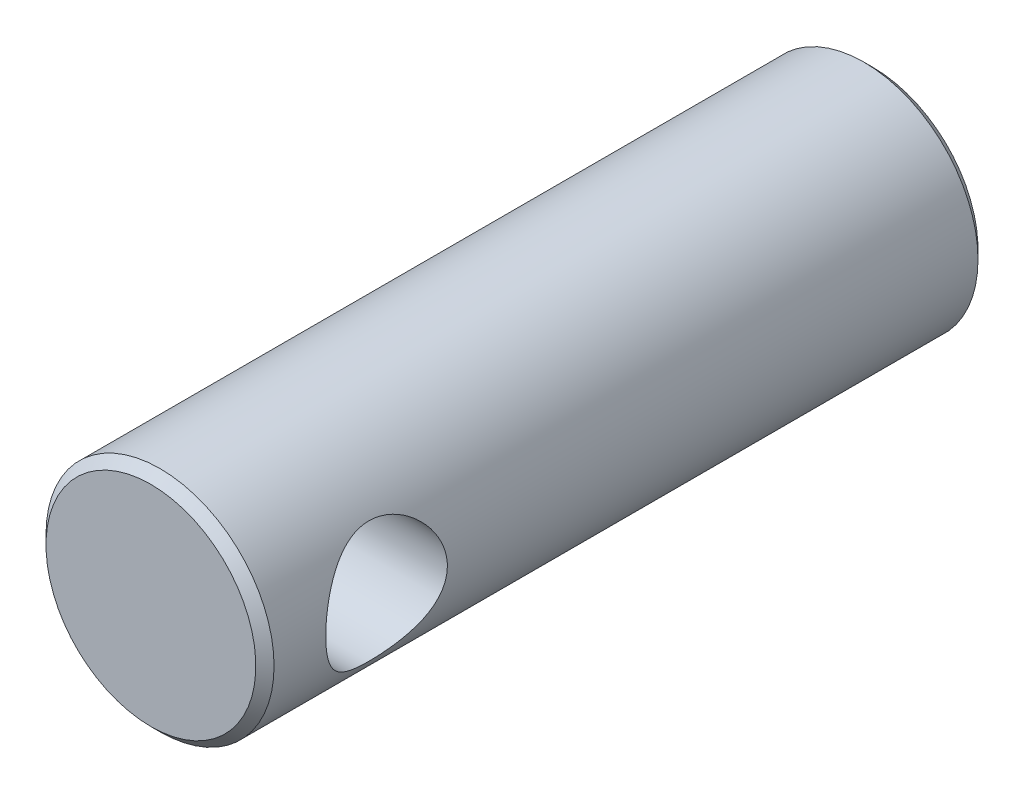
ISO-10303-21;
HEADER;
FILE_DESCRIPTION(('STEP AP214'),'2;1');
FILE_NAME('part.step','',(''),(''),'','','');
FILE_SCHEMA(('AUTOMOTIVE_DESIGN { 1 0 10303 214 1 1 1 1 }'));
ENDSEC;
DATA;
#1=APPLICATION_CONTEXT('core data for automotive mechanical design processes');
#2=APPLICATION_PROTOCOL_DEFINITION('international standard','automotive_design',2000,#1);
#3=PRODUCT_CONTEXT('',#1,'mechanical');
#4=PRODUCT('Part','Part','',(#3));
#5=PRODUCT_RELATED_PRODUCT_CATEGORY('part','',(#4));
#6=PRODUCT_DEFINITION_FORMATION('','',#4);
#7=PRODUCT_DEFINITION_CONTEXT('part definition',#1,'design');
#8=PRODUCT_DEFINITION('design','',#6,#7);
#9=PRODUCT_DEFINITION_SHAPE('','',#8);
#10=(LENGTH_UNIT() NAMED_UNIT(*) SI_UNIT(.MILLI.,.METRE.));
#11=(NAMED_UNIT(*) PLANE_ANGLE_UNIT() SI_UNIT($,.RADIAN.));
#12=(NAMED_UNIT(*) SI_UNIT($,.STERADIAN.) SOLID_ANGLE_UNIT());
#13=UNCERTAINTY_MEASURE_WITH_UNIT(LENGTH_MEASURE(1.E-05),#10,'distance_accuracy_value','');
#14=(GEOMETRIC_REPRESENTATION_CONTEXT(3) GLOBAL_UNCERTAINTY_ASSIGNED_CONTEXT((#13)) GLOBAL_UNIT_ASSIGNED_CONTEXT((#10,
#11,#12)) REPRESENTATION_CONTEXT('',''));
#15=CARTESIAN_POINT('',(0.,0.,0.));
#16=DIRECTION('',(0.,0.,1.));
#17=DIRECTION('',(1.,0.,0.));
#18=AXIS2_PLACEMENT_3D('',#15,#16,#17);
#19=CARTESIAN_POINT('',(0.,0.,0.));
#20=DIRECTION('',(0.,0.,-1.));
#21=DIRECTION('',(0.,1.,0.));
#22=AXIS2_PLACEMENT_3D('',#19,#20,#21);
#23=CYLINDRICAL_SURFACE('',#22,15.);
#24=CARTESIAN_POINT('',(0.,0.,1.2));
#25=DIRECTION('',(0.,0.,-1.));
#26=DIRECTION('',(0.,1.,0.));
#27=AXIS2_PLACEMENT_3D('',#24,#25,#26);
#28=CIRCLE('',#27,15.);
#29=CARTESIAN_POINT('',(0.,15.,1.2));
#30=VERTEX_POINT('',#29);
#31=EDGE_CURVE('E23',#30,#30,#28,.T.);
#32=ORIENTED_EDGE('',*,*,#31,.F.);
#33=EDGE_LOOP('',(#32));
#34=FACE_BOUND('',#33,.T.);
#35=CARTESIAN_POINT('',(15.,0.,71.));
#36=CARTESIAN_POINT('',(15.0000007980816,-0.208658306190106,70.9999990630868));
#37=CARTESIAN_POINT('',(14.9956371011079,-0.417305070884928,71.0081716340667));
#38=CARTESIAN_POINT('',(14.9782955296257,-0.833039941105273,71.0407582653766));
#39=CARTESIAN_POINT('',(14.9653146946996,-1.04012748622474,71.0651779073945));
#40=CARTESIAN_POINT('',(14.9310511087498,-1.45132026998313,71.1299909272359));
#41=CARTESIAN_POINT('',(14.9097590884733,-1.65542191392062,71.1704021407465));
#42=CARTESIAN_POINT('',(14.8594000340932,-2.05903163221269,71.2667306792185));
#43=CARTESIAN_POINT('',(14.830329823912,-2.25853779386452,71.3226543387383));
#44=CARTESIAN_POINT('',(14.7652710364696,-2.65067909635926,71.4490959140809));
#45=CARTESIAN_POINT('',(14.7293142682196,-2.8433411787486,71.5195468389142));
#46=CARTESIAN_POINT('',(14.6512130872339,-3.22169075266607,71.6745290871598));
#47=CARTESIAN_POINT('',(14.6090663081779,-3.40737554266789,71.7590657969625));
#48=CARTESIAN_POINT('',(14.5195395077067,-3.77066898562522,71.941435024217));
#49=CARTESIAN_POINT('',(14.4721619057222,-3.94828131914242,72.039261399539));
#50=CARTESIAN_POINT('',(14.3731581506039,-4.29474669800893,72.2475154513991));
#51=CARTESIAN_POINT('',(14.3215304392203,-4.4635964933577,72.357947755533));
#52=CARTESIAN_POINT('',(14.1548440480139,-4.97747471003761,72.7223845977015));
#53=CARTESIAN_POINT('',(14.0340440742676,-5.30593331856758,72.9975903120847));
#54=CARTESIAN_POINT('',(13.7886715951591,-5.91442733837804,73.5961172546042));
#55=CARTESIAN_POINT('',(13.6640958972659,-6.19442034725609,73.9194801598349));
#56=CARTESIAN_POINT('',(13.4779370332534,-6.58549011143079,74.4518395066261));
#57=CARTESIAN_POINT('',(13.4134290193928,-6.71554939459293,74.6461197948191));
#58=CARTESIAN_POINT('',(13.2888738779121,-6.95877033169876,75.0464750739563));
#59=CARTESIAN_POINT('',(13.2288276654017,-7.07192852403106,75.2525524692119));
#60=CARTESIAN_POINT('',(13.115350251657,-7.28022427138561,75.6752689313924));
#61=CARTESIAN_POINT('',(13.0619164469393,-7.37536892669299,75.8919037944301));
#62=CARTESIAN_POINT('',(12.963760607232,-7.54656572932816,76.3343741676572));
#63=CARTESIAN_POINT('',(12.9190331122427,-7.62262985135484,76.5602038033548));
#64=CARTESIAN_POINT('',(12.8426706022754,-7.75054950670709,77.0052074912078));
#65=CARTESIAN_POINT('',(12.8103945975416,-7.80361590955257,77.2239227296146));
#66=CARTESIAN_POINT('',(12.7565853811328,-7.89127290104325,77.6663401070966));
#67=CARTESIAN_POINT('',(12.7350516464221,-7.92586438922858,77.8900420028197));
#68=CARTESIAN_POINT('',(12.7037417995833,-7.97595273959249,78.3401523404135));
#69=CARTESIAN_POINT('',(12.6939529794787,-7.99147024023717,78.5665575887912));
#70=CARTESIAN_POINT('',(12.6865688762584,-8.00318856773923,79.0200544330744));
#71=CARTESIAN_POINT('',(12.6889721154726,-7.99939173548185,79.2471459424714));
#72=CARTESIAN_POINT('',(12.7046500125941,-7.97446092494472,79.6677563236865));
#73=CARTESIAN_POINT('',(12.7163427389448,-7.9558490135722,79.8614907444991));
#74=CARTESIAN_POINT('',(12.7482108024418,-7.90468417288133,80.2464672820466));
#75=CARTESIAN_POINT('',(12.7683888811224,-7.87212673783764,80.4377085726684));
#76=CARTESIAN_POINT('',(12.8165471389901,-7.79347407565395,80.8163582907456));
#77=CARTESIAN_POINT('',(12.8445268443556,-7.74737967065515,81.003766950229));
#78=CARTESIAN_POINT('',(12.907419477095,-7.64213821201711,81.3737596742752));
#79=CARTESIAN_POINT('',(12.9423351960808,-7.58298590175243,81.5563417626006));
#80=CARTESIAN_POINT('',(13.0189158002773,-7.45075778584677,81.9196575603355));
#81=CARTESIAN_POINT('',(13.0607123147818,-7.3774041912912,82.1002621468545));
#82=CARTESIAN_POINT('',(13.1493462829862,-7.21823996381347,82.4546727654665));
#83=CARTESIAN_POINT('',(13.1961853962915,-7.13242522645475,82.6284765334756));
#84=CARTESIAN_POINT('',(13.2937287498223,-6.94892586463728,82.9685986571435));
#85=CARTESIAN_POINT('',(13.3444336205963,-6.85123930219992,83.1349157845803));
#86=CARTESIAN_POINT('',(13.4485432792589,-6.64455222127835,83.4594783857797));
#87=CARTESIAN_POINT('',(13.5019482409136,-6.53555097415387,83.6177233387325));
#88=CARTESIAN_POINT('',(13.6183015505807,-6.28990792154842,83.9482789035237));
#89=CARTESIAN_POINT('',(13.6814984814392,-6.15155855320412,84.1192362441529));
#90=CARTESIAN_POINT('',(13.808316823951,-5.8613534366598,84.4491101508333));
#91=CARTESIAN_POINT('',(13.8719382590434,-5.70949693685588,84.6080260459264));
#92=CARTESIAN_POINT('',(13.9980647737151,-5.39288708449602,84.9131314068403));
#93=CARTESIAN_POINT('',(14.0605692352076,-5.22812684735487,85.0593139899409));
#94=CARTESIAN_POINT('',(14.1829191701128,-4.88648449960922,85.3380501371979));
#95=CARTESIAN_POINT('',(14.2427642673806,-4.70960068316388,85.470601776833));
#96=CARTESIAN_POINT('',(14.3617991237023,-4.3335781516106,85.7286819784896));
#97=CARTESIAN_POINT('',(14.4207346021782,-4.13374098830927,85.8533133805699));
#98=CARTESIAN_POINT('',(14.532297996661,-3.72258788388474,86.0850544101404));
#99=CARTESIAN_POINT('',(14.584928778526,-3.51127722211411,86.1921720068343));
#100=CARTESIAN_POINT('',(14.6823580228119,-3.07855763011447,86.3877483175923));
#101=CARTESIAN_POINT('',(14.7271600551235,-2.85715336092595,86.476215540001));
#102=CARTESIAN_POINT('',(14.807581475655,-2.40583464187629,86.6334157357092));
#103=CARTESIAN_POINT('',(14.8432020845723,-2.17592132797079,86.7021513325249));
#104=CARTESIAN_POINT('',(14.9013787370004,-1.73052917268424,86.8136505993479));
#105=CARTESIAN_POINT('',(14.9248213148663,-1.51561049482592,86.8581934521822));
#106=CARTESIAN_POINT('',(14.9625032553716,-1.08204807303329,86.9295286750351));
#107=CARTESIAN_POINT('',(14.9767431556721,-0.863404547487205,86.956322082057));
#108=CARTESIAN_POINT('',(14.9956057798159,-0.42434516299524,86.9917718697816));
#109=CARTESIAN_POINT('',(15.0002331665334,-0.203930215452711,87.0004370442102));
#110=CARTESIAN_POINT('',(14.9997487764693,0.23684557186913,86.9995290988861));
#111=CARTESIAN_POINT('',(14.9946375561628,0.457206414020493,86.9899570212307));
#112=CARTESIAN_POINT('',(14.9757321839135,0.875960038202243,86.9544170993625));
#113=CARTESIAN_POINT('',(14.962770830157,1.0745264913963,86.9300211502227));
#114=CARTESIAN_POINT('',(14.9292333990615,1.46871615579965,86.8665581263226));
#115=CARTESIAN_POINT('',(14.908654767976,1.66433835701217,86.8274861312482));
#116=CARTESIAN_POINT('',(14.8603667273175,2.05121802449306,86.735117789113));
#117=CARTESIAN_POINT('',(14.832659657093,2.24247690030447,86.6818261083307));
#118=CARTESIAN_POINT('',(14.7707189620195,2.61961877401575,86.5615339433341));
#119=CARTESIAN_POINT('',(14.7364827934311,2.8054996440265,86.4945281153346));
#120=CARTESIAN_POINT('',(14.6613087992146,3.17529209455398,86.3456252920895));
#121=CARTESIAN_POINT('',(14.6202272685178,3.35904370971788,86.2634035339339));
#122=CARTESIAN_POINT('',(14.532868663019,3.71887954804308,86.0859170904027));
#123=CARTESIAN_POINT('',(14.4865898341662,3.89496115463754,85.9906479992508));
#124=CARTESIAN_POINT('',(14.3413840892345,4.41042878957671,85.6863461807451));
#125=CARTESIAN_POINT('',(14.236045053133,4.73724051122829,85.4587364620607));
#126=CARTESIAN_POINT('',(14.0047357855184,5.38498983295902,84.9324816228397));
#127=CARTESIAN_POINT('',(13.8777653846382,5.70150577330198,84.628826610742));
#128=CARTESIAN_POINT('',(13.6884327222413,6.13611860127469,84.1377022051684));
#129=CARTESIAN_POINT('',(13.6254581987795,6.2743921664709,83.967901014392));
#130=CARTESIAN_POINT('',(13.5014696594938,6.53692255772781,83.6169941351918));
#131=CARTESIAN_POINT('',(13.4404559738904,6.6611770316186,83.4358865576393));
#132=CARTESIAN_POINT('',(13.3180882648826,6.902760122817,83.050563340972));
#133=CARTESIAN_POINT('',(13.2569910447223,7.01904976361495,82.8456133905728));
#134=CARTESIAN_POINT('',(13.1411233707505,7.23365367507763,82.4249054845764));
#135=CARTESIAN_POINT('',(13.0863498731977,7.33197660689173,82.2091528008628));
#136=CARTESIAN_POINT('',(12.9852656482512,7.50954838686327,81.7682325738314));
#137=CARTESIAN_POINT('',(12.9389473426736,7.5888143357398,81.5430736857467));
#138=CARTESIAN_POINT('',(12.8567378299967,7.72727610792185,81.0848171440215));
#139=CARTESIAN_POINT('',(12.820844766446,7.78647550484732,80.8517209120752));
#140=CARTESIAN_POINT('',(12.7641343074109,7.87905601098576,80.4027647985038));
#141=CARTESIAN_POINT('',(12.7421850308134,7.91439731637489,80.1874515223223));
#142=CARTESIAN_POINT('',(12.7091131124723,7.96739801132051,79.7538308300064));
#143=CARTESIAN_POINT('',(12.6979896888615,7.98505867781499,79.5355236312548));
#144=CARTESIAN_POINT('',(12.6870729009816,8.00239256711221,79.098039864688));
#145=CARTESIAN_POINT('',(12.6872729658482,8.00207622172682,78.8788638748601));
#146=CARTESIAN_POINT('',(12.6989789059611,7.98348651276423,78.4415891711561));
#147=CARTESIAN_POINT('',(12.7104840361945,7.96521433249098,78.2234903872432));
#148=CARTESIAN_POINT('',(12.7422128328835,7.91433991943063,77.8168004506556));
#149=CARTESIAN_POINT('',(12.7612019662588,7.88375731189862,77.6278547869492));
#150=CARTESIAN_POINT('',(12.806866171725,7.80935874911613,77.2534742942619));
#151=CARTESIAN_POINT('',(12.8335437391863,7.76553849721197,77.0680406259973));
#152=CARTESIAN_POINT('',(12.8937577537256,7.66514385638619,76.7018243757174));
#153=CARTESIAN_POINT('',(12.9272935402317,7.6085706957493,76.5210413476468));
#154=CARTESIAN_POINT('',(13.0002704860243,7.48319605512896,76.1649604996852));
#155=CARTESIAN_POINT('',(13.0397139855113,7.41438972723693,75.9896648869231));
#156=CARTESIAN_POINT('',(13.1707317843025,7.18087941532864,75.4511633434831));
#157=CARTESIAN_POINT('',(13.2709636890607,6.99548439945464,75.0988050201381));
#158=CARTESIAN_POINT('',(13.4834172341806,6.5766599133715,74.4278898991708));
#159=CARTESIAN_POINT('',(13.5956453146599,6.34320457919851,74.1093514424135));
#160=CARTESIAN_POINT('',(13.7738790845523,5.94187758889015,73.6385767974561));
#161=CARTESIAN_POINT('',(13.8391534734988,5.78858309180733,73.4734207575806));
#162=CARTESIAN_POINT('',(13.9687530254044,5.46842966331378,73.1564577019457));
#163=CARTESIAN_POINT('',(14.0330784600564,5.30157470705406,73.0046468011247));
#164=CARTESIAN_POINT('',(14.1591945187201,4.95492295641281,72.7151147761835));
#165=CARTESIAN_POINT('',(14.2209830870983,4.77511597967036,72.5774049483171));
#166=CARTESIAN_POINT('',(14.3404069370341,4.40350046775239,72.3171381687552));
#167=CARTESIAN_POINT('',(14.3980417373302,4.21169054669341,72.194582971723));
#168=CARTESIAN_POINT('',(14.5089957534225,3.81222423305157,71.9628441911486));
#169=CARTESIAN_POINT('',(14.5621739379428,3.60429410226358,71.854063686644));
#170=CARTESIAN_POINT('',(14.6610439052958,3.17829676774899,71.6546816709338));
#171=CARTESIAN_POINT('',(14.7067393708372,2.96023461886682,71.5640712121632));
#172=CARTESIAN_POINT('',(14.7892255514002,2.51590029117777,71.4022350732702));
#173=CARTESIAN_POINT('',(14.826034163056,2.28964568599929,71.3309703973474));
#174=CARTESIAN_POINT('',(14.8896933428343,1.83049251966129,71.2086136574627));
#175=CARTESIAN_POINT('',(14.9165494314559,1.5975977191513,71.1575104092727));
#176=CARTESIAN_POINT('',(14.958452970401,1.13815652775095,71.0781065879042));
#177=CARTESIAN_POINT('',(14.9739917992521,0.911819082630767,71.0488555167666));
#178=CARTESIAN_POINT('',(14.9947649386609,0.456983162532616,71.0098026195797));
#179=CARTESIAN_POINT('',(14.9999991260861,0.228484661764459,71.0000010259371));
#180=CARTESIAN_POINT('',(15.,0.,71.));
#181=B_SPLINE_CURVE_WITH_KNOTS('',3,(#35,#36,#37,#38,#39,#40,#41,#42,#43,#44,#45,#46,#47,#48,
#49,#50,#51,#52,#53,#54,#55,#56,#57,#58,#59,#60,#61,#62,#63,#64,#65,#66,#67,#68,#69,#70,#71,#72,
#73,#74,#75,#76,#77,#78,#79,#80,#81,#82,#83,#84,#85,#86,#87,#88,#89,#90,#91,#92,#93,#94,#95,#96,
#97,#98,#99,#100,#101,#102,#103,#104,#105,#106,#107,#108,#109,#110,#111,#112,#113,#114,#115,
#116,#117,#118,#119,#120,#121,#122,#123,#124,#125,#126,#127,#128,#129,#130,#131,#132,#133,#134,
#135,#136,#137,#138,#139,#140,#141,#142,#143,#144,#145,#146,#147,#148,#149,#150,#151,#152,#153,
#154,#155,#156,#157,#158,#159,#160,#161,#162,#163,#164,#165,#166,#167,#168,#169,#170,#171,#172,
#173,#174,#175,#176,#177,#178,#179,#180),.UNSPECIFIED.,.T.,.F.,(4,2,2,2,2,2,2,2,2,2,2,2,2,2,2,2,
2,2,2,2,2,2,2,2,2,2,2,2,2,2,2,2,2,2,2,2,2,2,2,2,2,2,2,2,2,2,2,2,2,2,2,2,2,2,2,2,2,2,2,2,2,2,2,2,
2,2,2,2,2,2,2,2,4),(0.,0.625750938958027,1.25171696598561,1.87838312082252,2.50530555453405,
3.12939918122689,3.75373201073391,4.37777726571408,5.00205234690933,6.33190215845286,
7.6629096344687,8.38972690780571,9.11669284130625,9.84337163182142,10.5695932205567,
11.2506745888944,11.9317227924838,12.6120334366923,13.2922616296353,13.8765020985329,
14.4609314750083,15.0453253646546,15.6299549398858,16.2274516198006,16.825145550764,
17.4229371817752,18.0207673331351,18.7065044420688,19.3922797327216,20.0784234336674,
20.764663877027,21.4920365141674,22.2190772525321,22.9457855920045,23.6723972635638,
24.3336957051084,24.9949555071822,25.6558944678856,26.3167956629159,26.9175324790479,
27.5184708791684,28.1192123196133,28.7201882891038,29.3358959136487,29.9518119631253,
31.1829817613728,32.5467200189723,33.2297017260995,33.9127978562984,34.6421568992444,
35.3711634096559,36.0995132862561,36.8277333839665,37.484661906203,38.1415429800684,
38.7980428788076,39.4544995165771,40.030889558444,40.6074668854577,41.1839887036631,
41.7607395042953,42.9874174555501,44.2147572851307,44.9178788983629,45.6207951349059,
46.3242701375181,47.0278265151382,47.7486893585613,48.469196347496,49.1882400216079,
49.9068842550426,50.5920847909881,51.2772935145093),.UNSPECIFIED.);
#182=CARTESIAN_POINT('',(15.,0.,71.));
#183=VERTEX_POINT('',#182);
#184=EDGE_CURVE('E30',#183,#183,#181,.T.);
#185=ORIENTED_EDGE('',*,*,#184,.T.);
#186=EDGE_LOOP('',(#185));
#187=FACE_BOUND('',#186,.T.);
#188=CARTESIAN_POINT('',(0.,0.,93.8));
#189=DIRECTION('',(0.,0.,-1.));
#190=DIRECTION('',(0.,1.,0.));
#191=AXIS2_PLACEMENT_3D('',#188,#189,#190);
#192=CIRCLE('',#191,15.);
#193=CARTESIAN_POINT('',(0.,15.,93.8));
#194=VERTEX_POINT('',#193);
#195=EDGE_CURVE('E37',#194,#194,#192,.T.);
#196=ORIENTED_EDGE('',*,*,#195,.T.);
#197=EDGE_LOOP('',(#196));
#198=FACE_BOUND('',#197,.T.);
#199=CARTESIAN_POINT('',(-15.,0.,71.));
#200=CARTESIAN_POINT('',(-15.0000007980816,0.208658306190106,70.9999990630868));
#201=CARTESIAN_POINT('',(-14.9956371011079,0.417305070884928,71.0081716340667));
#202=CARTESIAN_POINT('',(-14.9782955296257,0.833039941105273,71.0407582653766));
#203=CARTESIAN_POINT('',(-14.9653146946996,1.04012748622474,71.0651779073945));
#204=CARTESIAN_POINT('',(-14.9310511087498,1.45132026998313,71.1299909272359));
#205=CARTESIAN_POINT('',(-14.9097590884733,1.65542191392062,71.1704021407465));
#206=CARTESIAN_POINT('',(-14.8594000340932,2.05903163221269,71.2667306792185));
#207=CARTESIAN_POINT('',(-14.830329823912,2.25853779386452,71.3226543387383));
#208=CARTESIAN_POINT('',(-14.7652710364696,2.65067909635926,71.4490959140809));
#209=CARTESIAN_POINT('',(-14.7293142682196,2.8433411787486,71.5195468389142));
#210=CARTESIAN_POINT('',(-14.6512130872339,3.22169075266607,71.6745290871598));
#211=CARTESIAN_POINT('',(-14.6090663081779,3.40737554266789,71.7590657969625));
#212=CARTESIAN_POINT('',(-14.5195395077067,3.77066898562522,71.941435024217));
#213=CARTESIAN_POINT('',(-14.4721619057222,3.94828131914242,72.039261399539));
#214=CARTESIAN_POINT('',(-14.3731581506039,4.29474669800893,72.2475154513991));
#215=CARTESIAN_POINT('',(-14.3215304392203,4.4635964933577,72.357947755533));
#216=CARTESIAN_POINT('',(-14.1548440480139,4.97747471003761,72.7223845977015));
#217=CARTESIAN_POINT('',(-14.0340440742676,5.30593331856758,72.9975903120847));
#218=CARTESIAN_POINT('',(-13.7886715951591,5.91442733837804,73.5961172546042));
#219=CARTESIAN_POINT('',(-13.6640958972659,6.19442034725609,73.9194801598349));
#220=CARTESIAN_POINT('',(-13.4779370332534,6.58549011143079,74.4518395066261));
#221=CARTESIAN_POINT('',(-13.4134290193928,6.71554939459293,74.6461197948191));
#222=CARTESIAN_POINT('',(-13.2888738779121,6.95877033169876,75.0464750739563));
#223=CARTESIAN_POINT('',(-13.2288276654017,7.07192852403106,75.2525524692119));
#224=CARTESIAN_POINT('',(-13.115350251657,7.28022427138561,75.6752689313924));
#225=CARTESIAN_POINT('',(-13.0619164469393,7.37536892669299,75.8919037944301));
#226=CARTESIAN_POINT('',(-12.963760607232,7.54656572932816,76.3343741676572));
#227=CARTESIAN_POINT('',(-12.9190331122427,7.62262985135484,76.5602038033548));
#228=CARTESIAN_POINT('',(-12.8426706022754,7.75054950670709,77.0052074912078));
#229=CARTESIAN_POINT('',(-12.8103945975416,7.80361590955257,77.2239227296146));
#230=CARTESIAN_POINT('',(-12.7565853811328,7.89127290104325,77.6663401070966));
#231=CARTESIAN_POINT('',(-12.7350516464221,7.92586438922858,77.8900420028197));
#232=CARTESIAN_POINT('',(-12.7037417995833,7.97595273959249,78.3401523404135));
#233=CARTESIAN_POINT('',(-12.6939529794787,7.99147024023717,78.5665575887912));
#234=CARTESIAN_POINT('',(-12.6865688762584,8.00318856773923,79.0200544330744));
#235=CARTESIAN_POINT('',(-12.6889721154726,7.99939173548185,79.2471459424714));
#236=CARTESIAN_POINT('',(-12.7046500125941,7.97446092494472,79.6677563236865));
#237=CARTESIAN_POINT('',(-12.7163427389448,7.9558490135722,79.8614907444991));
#238=CARTESIAN_POINT('',(-12.7482108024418,7.90468417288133,80.2464672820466));
#239=CARTESIAN_POINT('',(-12.7683888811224,7.87212673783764,80.4377085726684));
#240=CARTESIAN_POINT('',(-12.8165471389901,7.79347407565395,80.8163582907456));
#241=CARTESIAN_POINT('',(-12.8445268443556,7.74737967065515,81.003766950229));
#242=CARTESIAN_POINT('',(-12.907419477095,7.64213821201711,81.3737596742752));
#243=CARTESIAN_POINT('',(-12.9423351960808,7.58298590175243,81.5563417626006));
#244=CARTESIAN_POINT('',(-13.0189158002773,7.45075778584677,81.9196575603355));
#245=CARTESIAN_POINT('',(-13.0607123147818,7.3774041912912,82.1002621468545));
#246=CARTESIAN_POINT('',(-13.1493462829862,7.21823996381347,82.4546727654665));
#247=CARTESIAN_POINT('',(-13.1961853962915,7.13242522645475,82.6284765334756));
#248=CARTESIAN_POINT('',(-13.2937287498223,6.94892586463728,82.9685986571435));
#249=CARTESIAN_POINT('',(-13.3444336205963,6.85123930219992,83.1349157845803));
#250=CARTESIAN_POINT('',(-13.4485432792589,6.64455222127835,83.4594783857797));
#251=CARTESIAN_POINT('',(-13.5019482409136,6.53555097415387,83.6177233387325));
#252=CARTESIAN_POINT('',(-13.6183015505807,6.28990792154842,83.9482789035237));
#253=CARTESIAN_POINT('',(-13.6814984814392,6.15155855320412,84.1192362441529));
#254=CARTESIAN_POINT('',(-13.808316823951,5.8613534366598,84.4491101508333));
#255=CARTESIAN_POINT('',(-13.8719382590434,5.70949693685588,84.6080260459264));
#256=CARTESIAN_POINT('',(-13.9980647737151,5.39288708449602,84.9131314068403));
#257=CARTESIAN_POINT('',(-14.0605692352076,5.22812684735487,85.0593139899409));
#258=CARTESIAN_POINT('',(-14.1829191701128,4.88648449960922,85.3380501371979));
#259=CARTESIAN_POINT('',(-14.2427642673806,4.70960068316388,85.470601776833));
#260=CARTESIAN_POINT('',(-14.3617991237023,4.3335781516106,85.7286819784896));
#261=CARTESIAN_POINT('',(-14.4207346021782,4.13374098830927,85.8533133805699));
#262=CARTESIAN_POINT('',(-14.532297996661,3.72258788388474,86.0850544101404));
#263=CARTESIAN_POINT('',(-14.584928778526,3.51127722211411,86.1921720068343));
#264=CARTESIAN_POINT('',(-14.6823580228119,3.07855763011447,86.3877483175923));
#265=CARTESIAN_POINT('',(-14.7271600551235,2.85715336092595,86.476215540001));
#266=CARTESIAN_POINT('',(-14.807581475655,2.40583464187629,86.6334157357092));
#267=CARTESIAN_POINT('',(-14.8432020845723,2.17592132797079,86.7021513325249));
#268=CARTESIAN_POINT('',(-14.9013787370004,1.73052917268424,86.8136505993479));
#269=CARTESIAN_POINT('',(-14.9248213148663,1.51561049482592,86.8581934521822));
#270=CARTESIAN_POINT('',(-14.9625032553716,1.08204807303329,86.9295286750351));
#271=CARTESIAN_POINT('',(-14.9767431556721,0.863404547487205,86.956322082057));
#272=CARTESIAN_POINT('',(-14.9956057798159,0.42434516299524,86.9917718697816));
#273=CARTESIAN_POINT('',(-15.0002331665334,0.203930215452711,87.0004370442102));
#274=CARTESIAN_POINT('',(-14.9997487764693,-0.23684557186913,86.9995290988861));
#275=CARTESIAN_POINT('',(-14.9946375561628,-0.457206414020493,86.9899570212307));
#276=CARTESIAN_POINT('',(-14.9757321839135,-0.875960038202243,86.9544170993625));
#277=CARTESIAN_POINT('',(-14.962770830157,-1.0745264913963,86.9300211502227));
#278=CARTESIAN_POINT('',(-14.9292333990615,-1.46871615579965,86.8665581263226));
#279=CARTESIAN_POINT('',(-14.908654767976,-1.66433835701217,86.8274861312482));
#280=CARTESIAN_POINT('',(-14.8603667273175,-2.05121802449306,86.735117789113));
#281=CARTESIAN_POINT('',(-14.832659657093,-2.24247690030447,86.6818261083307));
#282=CARTESIAN_POINT('',(-14.7707189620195,-2.61961877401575,86.5615339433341));
#283=CARTESIAN_POINT('',(-14.7364827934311,-2.8054996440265,86.4945281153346));
#284=CARTESIAN_POINT('',(-14.6613087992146,-3.17529209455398,86.3456252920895));
#285=CARTESIAN_POINT('',(-14.6202272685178,-3.35904370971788,86.2634035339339));
#286=CARTESIAN_POINT('',(-14.532868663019,-3.71887954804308,86.0859170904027));
#287=CARTESIAN_POINT('',(-14.4865898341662,-3.89496115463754,85.9906479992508));
#288=CARTESIAN_POINT('',(-14.3413840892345,-4.41042878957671,85.6863461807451));
#289=CARTESIAN_POINT('',(-14.236045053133,-4.73724051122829,85.4587364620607));
#290=CARTESIAN_POINT('',(-14.0047357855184,-5.38498983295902,84.9324816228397));
#291=CARTESIAN_POINT('',(-13.8777653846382,-5.70150577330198,84.628826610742));
#292=CARTESIAN_POINT('',(-13.6884327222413,-6.13611860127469,84.1377022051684));
#293=CARTESIAN_POINT('',(-13.6254581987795,-6.2743921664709,83.967901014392));
#294=CARTESIAN_POINT('',(-13.5014696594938,-6.53692255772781,83.6169941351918));
#295=CARTESIAN_POINT('',(-13.4404559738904,-6.6611770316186,83.4358865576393));
#296=CARTESIAN_POINT('',(-13.3180882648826,-6.902760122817,83.050563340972));
#297=CARTESIAN_POINT('',(-13.2569910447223,-7.01904976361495,82.8456133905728));
#298=CARTESIAN_POINT('',(-13.1411233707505,-7.23365367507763,82.4249054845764));
#299=CARTESIAN_POINT('',(-13.0863498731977,-7.33197660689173,82.2091528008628));
#300=CARTESIAN_POINT('',(-12.9852656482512,-7.50954838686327,81.7682325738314));
#301=CARTESIAN_POINT('',(-12.9389473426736,-7.5888143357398,81.5430736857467));
#302=CARTESIAN_POINT('',(-12.8567378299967,-7.72727610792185,81.0848171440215));
#303=CARTESIAN_POINT('',(-12.820844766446,-7.78647550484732,80.8517209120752));
#304=CARTESIAN_POINT('',(-12.7641343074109,-7.87905601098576,80.4027647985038));
#305=CARTESIAN_POINT('',(-12.7421850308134,-7.91439731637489,80.1874515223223));
#306=CARTESIAN_POINT('',(-12.7091131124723,-7.96739801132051,79.7538308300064));
#307=CARTESIAN_POINT('',(-12.6979896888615,-7.98505867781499,79.5355236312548));
#308=CARTESIAN_POINT('',(-12.6870729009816,-8.00239256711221,79.098039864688));
#309=CARTESIAN_POINT('',(-12.6872729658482,-8.00207622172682,78.8788638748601));
#310=CARTESIAN_POINT('',(-12.6989789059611,-7.98348651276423,78.4415891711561));
#311=CARTESIAN_POINT('',(-12.7104840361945,-7.96521433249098,78.2234903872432));
#312=CARTESIAN_POINT('',(-12.7422128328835,-7.91433991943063,77.8168004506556));
#313=CARTESIAN_POINT('',(-12.7612019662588,-7.88375731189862,77.6278547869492));
#314=CARTESIAN_POINT('',(-12.806866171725,-7.80935874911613,77.2534742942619));
#315=CARTESIAN_POINT('',(-12.8335437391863,-7.76553849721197,77.0680406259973));
#316=CARTESIAN_POINT('',(-12.8937577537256,-7.66514385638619,76.7018243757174));
#317=CARTESIAN_POINT('',(-12.9272935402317,-7.6085706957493,76.5210413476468));
#318=CARTESIAN_POINT('',(-13.0002704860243,-7.48319605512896,76.1649604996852));
#319=CARTESIAN_POINT('',(-13.0397139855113,-7.41438972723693,75.9896648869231));
#320=CARTESIAN_POINT('',(-13.1707317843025,-7.18087941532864,75.4511633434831));
#321=CARTESIAN_POINT('',(-13.2709636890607,-6.99548439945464,75.0988050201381));
#322=CARTESIAN_POINT('',(-13.4834172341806,-6.5766599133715,74.4278898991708));
#323=CARTESIAN_POINT('',(-13.5956453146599,-6.34320457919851,74.1093514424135));
#324=CARTESIAN_POINT('',(-13.7738790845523,-5.94187758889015,73.6385767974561));
#325=CARTESIAN_POINT('',(-13.8391534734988,-5.78858309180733,73.4734207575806));
#326=CARTESIAN_POINT('',(-13.9687530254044,-5.46842966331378,73.1564577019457));
#327=CARTESIAN_POINT('',(-14.0330784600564,-5.30157470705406,73.0046468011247));
#328=CARTESIAN_POINT('',(-14.1591945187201,-4.95492295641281,72.7151147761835));
#329=CARTESIAN_POINT('',(-14.2209830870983,-4.77511597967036,72.5774049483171));
#330=CARTESIAN_POINT('',(-14.3404069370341,-4.40350046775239,72.3171381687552));
#331=CARTESIAN_POINT('',(-14.3980417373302,-4.21169054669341,72.194582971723));
#332=CARTESIAN_POINT('',(-14.5089957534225,-3.81222423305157,71.9628441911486));
#333=CARTESIAN_POINT('',(-14.5621739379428,-3.60429410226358,71.854063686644));
#334=CARTESIAN_POINT('',(-14.6610439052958,-3.17829676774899,71.6546816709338));
#335=CARTESIAN_POINT('',(-14.7067393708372,-2.96023461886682,71.5640712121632));
#336=CARTESIAN_POINT('',(-14.7892255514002,-2.51590029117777,71.4022350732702));
#337=CARTESIAN_POINT('',(-14.826034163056,-2.28964568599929,71.3309703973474));
#338=CARTESIAN_POINT('',(-14.8896933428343,-1.83049251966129,71.2086136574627));
#339=CARTESIAN_POINT('',(-14.9165494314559,-1.5975977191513,71.1575104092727));
#340=CARTESIAN_POINT('',(-14.958452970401,-1.13815652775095,71.0781065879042));
#341=CARTESIAN_POINT('',(-14.9739917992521,-0.911819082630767,71.0488555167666));
#342=CARTESIAN_POINT('',(-14.9947649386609,-0.456983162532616,71.0098026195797));
#343=CARTESIAN_POINT('',(-14.9999991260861,-0.228484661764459,71.0000010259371));
#344=CARTESIAN_POINT('',(-15.,0.,71.));
#345=B_SPLINE_CURVE_WITH_KNOTS('',3,(#199,#200,#201,#202,#203,#204,#205,#206,#207,#208,#209,
#210,#211,#212,#213,#214,#215,#216,#217,#218,#219,#220,#221,#222,#223,#224,#225,#226,#227,#228,
#229,#230,#231,#232,#233,#234,#235,#236,#237,#238,#239,#240,#241,#242,#243,#244,#245,#246,#247,
#248,#249,#250,#251,#252,#253,#254,#255,#256,#257,#258,#259,#260,#261,#262,#263,#264,#265,#266,
#267,#268,#269,#270,#271,#272,#273,#274,#275,#276,#277,#278,#279,#280,#281,#282,#283,#284,#285,
#286,#287,#288,#289,#290,#291,#292,#293,#294,#295,#296,#297,#298,#299,#300,#301,#302,#303,#304,
#305,#306,#307,#308,#309,#310,#311,#312,#313,#314,#315,#316,#317,#318,#319,#320,#321,#322,#323,
#324,#325,#326,#327,#328,#329,#330,#331,#332,#333,#334,#335,#336,#337,#338,#339,#340,#341,#342,
#343,#344),.UNSPECIFIED.,.T.,.F.,(4,2,2,2,2,2,2,2,2,2,2,2,2,2,2,2,2,2,2,2,2,2,2,2,2,2,2,2,2,2,2,
2,2,2,2,2,2,2,2,2,2,2,2,2,2,2,2,2,2,2,2,2,2,2,2,2,2,2,2,2,2,2,2,2,2,2,2,2,2,2,2,2,4),(0.,
0.625750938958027,1.25171696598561,1.87838312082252,2.50530555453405,3.12939918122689,
3.75373201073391,4.37777726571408,5.00205234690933,6.33190215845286,7.6629096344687,
8.38972690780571,9.11669284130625,9.84337163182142,10.5695932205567,11.2506745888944,
11.9317227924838,12.6120334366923,13.2922616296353,13.8765020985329,14.4609314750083,
15.0453253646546,15.6299549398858,16.2274516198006,16.825145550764,17.4229371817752,
18.0207673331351,18.7065044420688,19.3922797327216,20.0784234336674,20.764663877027,
21.4920365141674,22.2190772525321,22.9457855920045,23.6723972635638,24.3336957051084,
24.9949555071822,25.6558944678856,26.3167956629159,26.9175324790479,27.5184708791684,
28.1192123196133,28.7201882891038,29.3358959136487,29.9518119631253,31.1829817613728,
32.5467200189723,33.2297017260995,33.9127978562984,34.6421568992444,35.3711634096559,
36.0995132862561,36.8277333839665,37.484661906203,38.1415429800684,38.7980428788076,
39.4544995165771,40.030889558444,40.6074668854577,41.1839887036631,41.7607395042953,
42.9874174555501,44.2147572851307,44.9178788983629,45.6207951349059,46.3242701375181,
47.0278265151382,47.7486893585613,48.469196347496,49.1882400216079,49.9068842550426,
50.5920847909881,51.2772935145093),.UNSPECIFIED.);
#346=CARTESIAN_POINT('',(-15.,0.,71.));
#347=VERTEX_POINT('',#346);
#348=EDGE_CURVE('E39',#347,#347,#345,.T.);
#349=ORIENTED_EDGE('',*,*,#348,.T.);
#350=EDGE_LOOP('',(#349));
#351=FACE_BOUND('',#350,.T.);
#352=ADVANCED_FACE('F12',(#34,#187,#198,#351),#23,.T.);
#353=CARTESIAN_POINT('',(13.8,0.,0.));
#354=DIRECTION('',(0.,0.,1.));
#355=DIRECTION('',(0.,-1.,0.));
#356=AXIS2_PLACEMENT_3D('',#353,#354,#355);
#357=PLANE('',#356);
#358=CARTESIAN_POINT('',(0.,0.,0.));
#359=DIRECTION('',(0.,0.,1.));
#360=DIRECTION('',(1.,0.,0.));
#361=AXIS2_PLACEMENT_3D('',#358,#359,#360);
#362=CIRCLE('',#361,11.1);
#363=CARTESIAN_POINT('',(11.1,0.,0.));
#364=VERTEX_POINT('',#363);
#365=EDGE_CURVE('E8',#364,#364,#362,.T.);
#366=ORIENTED_EDGE('',*,*,#365,.T.);
#367=EDGE_LOOP('',(#366));
#368=FACE_BOUND('',#367,.T.);
#369=CARTESIAN_POINT('',(0.,0.,0.));
#370=DIRECTION('',(0.,0.,-1.));
#371=DIRECTION('',(0.,1.,0.));
#372=AXIS2_PLACEMENT_3D('',#369,#370,#371);
#373=CIRCLE('',#372,13.8);
#374=CARTESIAN_POINT('',(0.,13.8,0.));
#375=VERTEX_POINT('',#374);
#376=EDGE_CURVE('E84',#375,#375,#373,.T.);
#377=ORIENTED_EDGE('',*,*,#376,.T.);
#378=EDGE_LOOP('',(#377));
#379=FACE_BOUND('',#378,.T.);
#380=ADVANCED_FACE('F54',(#368,#379),#357,.F.);
#381=CARTESIAN_POINT('',(0.,0.,95.));
#382=DIRECTION('',(0.,0.,-1.));
#383=DIRECTION('',(0.,1.,0.));
#384=AXIS2_PLACEMENT_3D('',#381,#382,#383);
#385=PLANE('',#384);
#386=CARTESIAN_POINT('',(0.,0.,95.));
#387=DIRECTION('',(0.,0.,-1.));
#388=DIRECTION('',(0.,1.,0.));
#389=AXIS2_PLACEMENT_3D('',#386,#387,#388);
#390=CIRCLE('',#389,13.8);
#391=CARTESIAN_POINT('',(0.,13.8,95.));
#392=VERTEX_POINT('',#391);
#393=EDGE_CURVE('E27',#392,#392,#390,.T.);
#394=ORIENTED_EDGE('',*,*,#393,.F.);
#395=EDGE_LOOP('',(#394));
#396=FACE_BOUND('',#395,.T.);
#397=ADVANCED_FACE('F57',(#396),#385,.F.);
#398=CARTESIAN_POINT('',(0.,0.,95.));
#399=DIRECTION('',(0.,0.,-1.));
#400=DIRECTION('',(0.,1.,0.));
#401=AXIS2_PLACEMENT_3D('',#398,#399,#400);
#402=CONICAL_SURFACE('',#401,13.8,0.785398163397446);
#403=ORIENTED_EDGE('',*,*,#195,.F.);
#404=EDGE_LOOP('',(#403));
#405=FACE_BOUND('',#404,.T.);
#406=ORIENTED_EDGE('',*,*,#393,.T.);
#407=EDGE_LOOP('',(#406));
#408=FACE_BOUND('',#407,.T.);
#409=ADVANCED_FACE('F59',(#405,#408),#402,.T.);
#410=CARTESIAN_POINT('',(0.,0.,1.2));
#411=DIRECTION('',(0.,0.,1.));
#412=DIRECTION('',(0.,-1.,0.));
#413=AXIS2_PLACEMENT_3D('',#410,#411,#412);
#414=CONICAL_SURFACE('',#413,15.,0.785398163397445);
#415=ORIENTED_EDGE('',*,*,#376,.F.);
#416=EDGE_LOOP('',(#415));
#417=FACE_BOUND('',#416,.T.);
#418=ORIENTED_EDGE('',*,*,#31,.T.);
#419=EDGE_LOOP('',(#418));
#420=FACE_BOUND('',#419,.T.);
#421=ADVANCED_FACE('F52',(#417,#420),#414,.T.);
#422=CARTESIAN_POINT('',(-29.001,0.,79.));
#423=DIRECTION('',(1.,0.,0.));
#424=DIRECTION('',(0.,0.,-1.));
#425=AXIS2_PLACEMENT_3D('',#422,#423,#424);
#426=CYLINDRICAL_SURFACE('',#425,8.);
#427=ORIENTED_EDGE('',*,*,#184,.F.);
#428=EDGE_LOOP('',(#427));
#429=FACE_BOUND('',#428,.T.);
#430=ORIENTED_EDGE('',*,*,#348,.F.);
#431=EDGE_LOOP('',(#430));
#432=FACE_BOUND('',#431,.T.);
#433=ADVANCED_FACE('F47',(#429,#432),#426,.F.);
#434=CARTESIAN_POINT('',(0.,0.,40.));
#435=DIRECTION('',(0.,0.,-1.));
#436=DIRECTION('',(-1.,0.,0.));
#437=AXIS2_PLACEMENT_3D('',#434,#435,#436);
#438=CYLINDRICAL_SURFACE('',#437,10.);
#439=CARTESIAN_POINT('',(0.,0.,1.1));
#440=DIRECTION('',(0.,0.,1.));
#441=DIRECTION('',(1.,0.,0.));
#442=AXIS2_PLACEMENT_3D('',#439,#440,#441);
#443=CIRCLE('',#442,10.);
#444=CARTESIAN_POINT('',(10.,0.,1.1));
#445=VERTEX_POINT('',#444);
#446=EDGE_CURVE('E19',#445,#445,#443,.F.);
#447=ORIENTED_EDGE('',*,*,#446,.T.);
#448=EDGE_LOOP('',(#447));
#449=FACE_BOUND('',#448,.T.);
#450=CARTESIAN_POINT('',(0.,0.,40.));
#451=DIRECTION('',(0.,0.,-1.));
#452=DIRECTION('',(-1.,0.,0.));
#453=AXIS2_PLACEMENT_3D('',#450,#451,#452);
#454=CIRCLE('',#453,10.);
#455=CARTESIAN_POINT('',(-10.,0.,40.));
#456=VERTEX_POINT('',#455);
#457=EDGE_CURVE('E38',#456,#456,#454,.T.);
#458=ORIENTED_EDGE('',*,*,#457,.F.);
#459=EDGE_LOOP('',(#458));
#460=FACE_BOUND('',#459,.T.);
#461=ADVANCED_FACE('F51',(#449,#460),#438,.F.);
#462=CARTESIAN_POINT('',(0.,0.,40.));
#463=DIRECTION('',(0.,0.,-1.));
#464=DIRECTION('',(-1.,0.,0.));
#465=AXIS2_PLACEMENT_3D('',#462,#463,#464);
#466=PLANE('',#465);
#467=ORIENTED_EDGE('',*,*,#457,.T.);
#468=EDGE_LOOP('',(#467));
#469=FACE_BOUND('',#468,.T.);
#470=ADVANCED_FACE('F93',(#469),#466,.T.);
#471=CARTESIAN_POINT('',(0.,0.,1.1));
#472=DIRECTION('',(0.,0.,-1.));
#473=DIRECTION('',(-1.,0.,0.));
#474=AXIS2_PLACEMENT_3D('',#471,#472,#473);
#475=CONICAL_SURFACE('',#474,10.,0.785398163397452);
#476=ORIENTED_EDGE('',*,*,#365,.F.);
#477=EDGE_LOOP('',(#476));
#478=FACE_BOUND('',#477,.T.);
#479=ORIENTED_EDGE('',*,*,#446,.F.);
#480=EDGE_LOOP('',(#479));
#481=FACE_BOUND('',#480,.T.);
#482=ADVANCED_FACE('F14',(#478,#481),#475,.F.);
#483=CLOSED_SHELL('',(#352,#380,#397,#409,#421,#433,#461,#470,#482));
#484=MANIFOLD_SOLID_BREP('B1',#483);
#485=ADVANCED_BREP_SHAPE_REPRESENTATION('',(#18,#484),#14);
#486=SHAPE_DEFINITION_REPRESENTATION(#9,#485);
ENDSEC;
END-ISO-10303-21;
